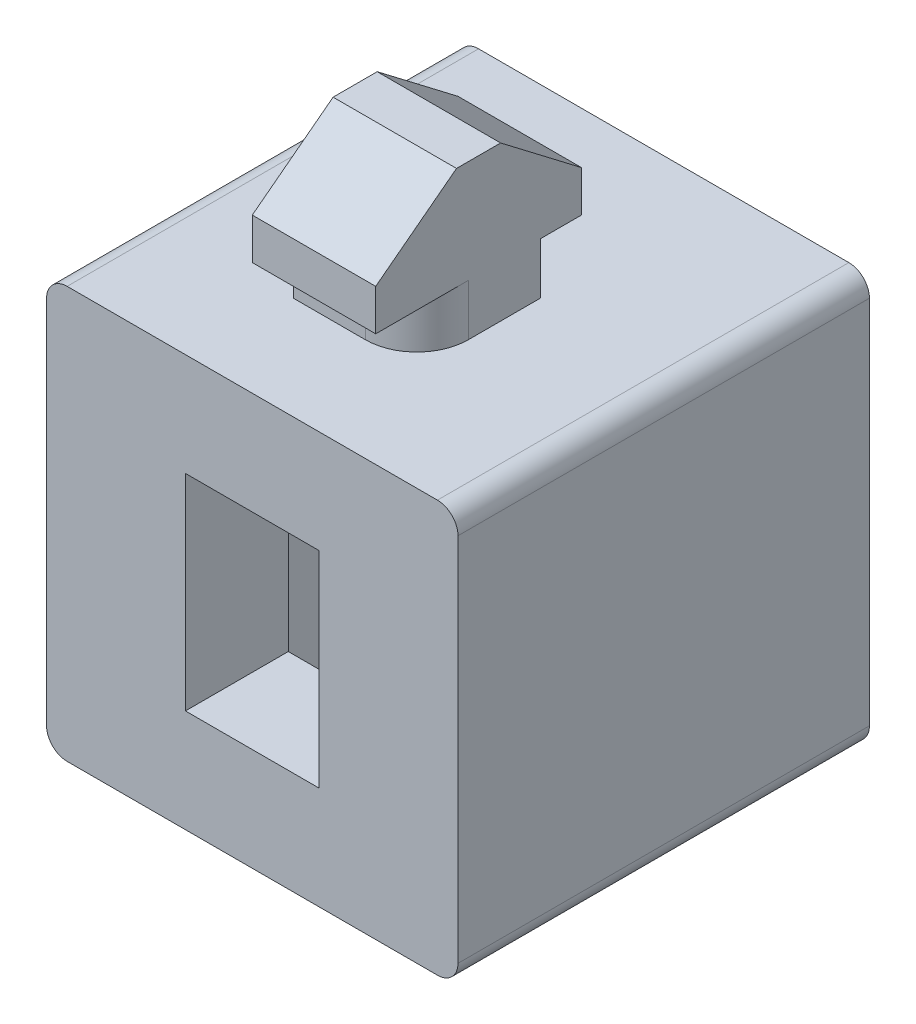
ISO-10303-21;
HEADER;
FILE_DESCRIPTION(('STEP AP214'),'2;1');
FILE_NAME('part.step','',(''),(''),'','','');
FILE_SCHEMA(('AUTOMOTIVE_DESIGN { 1 0 10303 214 1 1 1 1 }'));
ENDSEC;
DATA;
#1=APPLICATION_CONTEXT('core data for automotive mechanical design processes');
#2=APPLICATION_PROTOCOL_DEFINITION('international standard','automotive_design',2000,#1);
#3=PRODUCT_CONTEXT('',#1,'mechanical');
#4=PRODUCT('Part','Part','',(#3));
#5=PRODUCT_RELATED_PRODUCT_CATEGORY('part','',(#4));
#6=PRODUCT_DEFINITION_FORMATION('','',#4);
#7=PRODUCT_DEFINITION_CONTEXT('part definition',#1,'design');
#8=PRODUCT_DEFINITION('design','',#6,#7);
#9=PRODUCT_DEFINITION_SHAPE('','',#8);
#10=(LENGTH_UNIT() NAMED_UNIT(*) SI_UNIT(.MILLI.,.METRE.));
#11=(NAMED_UNIT(*) PLANE_ANGLE_UNIT() SI_UNIT($,.RADIAN.));
#12=(NAMED_UNIT(*) SI_UNIT($,.STERADIAN.) SOLID_ANGLE_UNIT());
#13=UNCERTAINTY_MEASURE_WITH_UNIT(LENGTH_MEASURE(1.E-05),#10,'distance_accuracy_value','');
#14=(GEOMETRIC_REPRESENTATION_CONTEXT(3) GLOBAL_UNCERTAINTY_ASSIGNED_CONTEXT((#13)) GLOBAL_UNIT_ASSIGNED_CONTEXT((#10,
#11,#12)) REPRESENTATION_CONTEXT('',''));
#15=CARTESIAN_POINT('',(0.,0.,0.));
#16=DIRECTION('',(0.,0.,1.));
#17=DIRECTION('',(1.,0.,0.));
#18=AXIS2_PLACEMENT_3D('',#15,#16,#17);
#19=CARTESIAN_POINT('',(-10.,10.,10.));
#20=DIRECTION('',(0.,-1.,0.));
#21=DIRECTION('',(1.,0.,0.));
#22=AXIS2_PLACEMENT_3D('',#19,#20,#21);
#23=PLANE('',#22);
#24=DIRECTION('',(-1.,0.,0.));
#25=VECTOR('',#24,1.);
#26=CARTESIAN_POINT('',(-10.,10.,10.));
#27=LINE('',#26,#25);
#28=CARTESIAN_POINT('',(9.,10.,10.));
#29=VERTEX_POINT('',#28);
#30=CARTESIAN_POINT('',(-9.,10.,10.));
#31=VERTEX_POINT('',#30);
#32=EDGE_CURVE('E382',#29,#31,#27,.T.);
#33=ORIENTED_EDGE('',*,*,#32,.F.);
#34=DIRECTION('',(0.,0.,-1.));
#35=VECTOR('',#34,1.);
#36=CARTESIAN_POINT('',(9.,10.,10.));
#37=LINE('',#36,#35);
#38=CARTESIAN_POINT('',(9.,10.,-10.));
#39=VERTEX_POINT('',#38);
#40=EDGE_CURVE('E328',#29,#39,#37,.T.);
#41=ORIENTED_EDGE('',*,*,#40,.T.);
#42=DIRECTION('',(-1.,0.,0.));
#43=VECTOR('',#42,1.);
#44=CARTESIAN_POINT('',(-10.,10.,-10.));
#45=LINE('',#44,#43);
#46=CARTESIAN_POINT('',(-9.,10.,-10.));
#47=VERTEX_POINT('',#46);
#48=EDGE_CURVE('E387',#39,#47,#45,.T.);
#49=ORIENTED_EDGE('',*,*,#48,.T.);
#50=DIRECTION('',(0.,0.,-1.));
#51=VECTOR('',#50,1.);
#52=CARTESIAN_POINT('',(-9.,10.,10.));
#53=LINE('',#52,#51);
#54=EDGE_CURVE('E326',#47,#31,#53,.F.);
#55=ORIENTED_EDGE('',*,*,#54,.T.);
#56=EDGE_LOOP('',(#33,#41,#49,#55));
#57=FACE_BOUND('',#56,.T.);
#58=DIRECTION('',(0.,0.,1.));
#59=VECTOR('',#58,1.);
#60=CARTESIAN_POINT('',(-3.,10.,-0.999999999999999));
#61=LINE('',#60,#59);
#62=CARTESIAN_POINT('',(-3.,10.,1.5));
#63=VERTEX_POINT('',#62);
#64=CARTESIAN_POINT('',(-3.,10.,5.));
#65=VERTEX_POINT('',#64);
#66=EDGE_CURVE('E305',#63,#65,#61,.T.);
#67=ORIENTED_EDGE('',*,*,#66,.F.);
#68=CARTESIAN_POINT('',(-0.500000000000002,10.,1.5));
#69=DIRECTION('',(0.,-1.,0.));
#70=DIRECTION('',(1.,0.,0.));
#71=AXIS2_PLACEMENT_3D('',#68,#69,#70);
#72=CIRCLE('',#71,2.5);
#73=CARTESIAN_POINT('',(-0.500000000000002,10.,-0.999999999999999));
#74=VERTEX_POINT('',#73);
#75=EDGE_CURVE('E400',#63,#74,#72,.T.);
#76=ORIENTED_EDGE('',*,*,#75,.T.);
#77=DIRECTION('',(-1.,0.,0.));
#78=VECTOR('',#77,1.);
#79=CARTESIAN_POINT('',(-3.,10.,-0.999999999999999));
#80=LINE('',#79,#78);
#81=CARTESIAN_POINT('',(3.,10.,-0.999999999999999));
#82=VERTEX_POINT('',#81);
#83=EDGE_CURVE('E302',#82,#74,#80,.T.);
#84=ORIENTED_EDGE('',*,*,#83,.F.);
#85=DIRECTION('',(0.,0.,-1.));
#86=VECTOR('',#85,1.);
#87=CARTESIAN_POINT('',(3.,10.,-0.999999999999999));
#88=LINE('',#87,#86);
#89=CARTESIAN_POINT('',(3.,10.,2.5));
#90=VERTEX_POINT('',#89);
#91=EDGE_CURVE('E577',#90,#82,#88,.T.);
#92=ORIENTED_EDGE('',*,*,#91,.F.);
#93=CARTESIAN_POINT('',(0.499999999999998,10.,2.5));
#94=DIRECTION('',(0.,-1.,0.));
#95=DIRECTION('',(1.,0.,0.));
#96=AXIS2_PLACEMENT_3D('',#93,#94,#95);
#97=CIRCLE('',#96,2.5);
#98=CARTESIAN_POINT('',(0.499999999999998,10.,5.));
#99=VERTEX_POINT('',#98);
#100=EDGE_CURVE('E329',#90,#99,#97,.T.);
#101=ORIENTED_EDGE('',*,*,#100,.T.);
#102=DIRECTION('',(1.,0.,0.));
#103=VECTOR('',#102,1.);
#104=CARTESIAN_POINT('',(-3.,10.,5.));
#105=LINE('',#104,#103);
#106=EDGE_CURVE('E574',#65,#99,#105,.T.);
#107=ORIENTED_EDGE('',*,*,#106,.F.);
#108=EDGE_LOOP('',(#67,#76,#84,#92,#101,#107));
#109=FACE_BOUND('',#108,.T.);
#110=ADVANCED_FACE('F34',(#57,#109),#23,.F.);
#111=CARTESIAN_POINT('',(-3.25,5.,10.));
#112=DIRECTION('',(1.,0.,0.));
#113=DIRECTION('',(0.,1.,0.));
#114=AXIS2_PLACEMENT_3D('',#111,#112,#113);
#115=PLANE('',#114);
#116=DIRECTION('',(0.,-1.,0.));
#117=VECTOR('',#116,1.);
#118=CARTESIAN_POINT('',(-3.25,5.,5.));
#119=LINE('',#118,#117);
#120=CARTESIAN_POINT('',(-3.25,5.,5.));
#121=VERTEX_POINT('',#120);
#122=CARTESIAN_POINT('',(-3.25,-5.,5.));
#123=VERTEX_POINT('',#122);
#124=EDGE_CURVE('E458',#121,#123,#119,.T.);
#125=ORIENTED_EDGE('',*,*,#124,.F.);
#126=DIRECTION('',(0.,0.,-1.));
#127=VECTOR('',#126,1.);
#128=CARTESIAN_POINT('',(-3.25,5.,10.));
#129=LINE('',#128,#127);
#130=CARTESIAN_POINT('',(-3.25,5.,10.));
#131=VERTEX_POINT('',#130);
#132=EDGE_CURVE('E482',#131,#121,#129,.T.);
#133=ORIENTED_EDGE('',*,*,#132,.F.);
#134=DIRECTION('',(0.,-1.,0.));
#135=VECTOR('',#134,1.);
#136=CARTESIAN_POINT('',(-3.25,5.,10.));
#137=LINE('',#136,#135);
#138=CARTESIAN_POINT('',(-3.25,-5.,10.));
#139=VERTEX_POINT('',#138);
#140=EDGE_CURVE('E461',#131,#139,#137,.T.);
#141=ORIENTED_EDGE('',*,*,#140,.T.);
#142=DIRECTION('',(0.,0.,-1.));
#143=VECTOR('',#142,1.);
#144=CARTESIAN_POINT('',(-3.25,-5.,10.));
#145=LINE('',#144,#143);
#146=EDGE_CURVE('E374',#139,#123,#145,.T.);
#147=ORIENTED_EDGE('',*,*,#146,.T.);
#148=EDGE_LOOP('',(#125,#133,#141,#147));
#149=FACE_BOUND('',#148,.T.);
#150=ADVANCED_FACE('F528',(#149),#115,.T.);
#151=CARTESIAN_POINT('',(-3.25,-5.,10.));
#152=DIRECTION('',(0.,1.,0.));
#153=DIRECTION('',(-1.,0.,0.));
#154=AXIS2_PLACEMENT_3D('',#151,#152,#153);
#155=PLANE('',#154);
#156=DIRECTION('',(1.,0.,0.));
#157=VECTOR('',#156,1.);
#158=CARTESIAN_POINT('',(-3.25,-5.,5.));
#159=LINE('',#158,#157);
#160=CARTESIAN_POINT('',(3.25,-5.,5.));
#161=VERTEX_POINT('',#160);
#162=EDGE_CURVE('E456',#123,#161,#159,.T.);
#163=ORIENTED_EDGE('',*,*,#162,.F.);
#164=ORIENTED_EDGE('',*,*,#146,.F.);
#165=DIRECTION('',(1.,0.,0.));
#166=VECTOR('',#165,1.);
#167=CARTESIAN_POINT('',(-3.25,-5.,10.));
#168=LINE('',#167,#166);
#169=CARTESIAN_POINT('',(3.25,-5.,10.));
#170=VERTEX_POINT('',#169);
#171=EDGE_CURVE('E463',#139,#170,#168,.T.);
#172=ORIENTED_EDGE('',*,*,#171,.T.);
#173=DIRECTION('',(0.,0.,-1.));
#174=VECTOR('',#173,1.);
#175=CARTESIAN_POINT('',(3.25,-5.,10.));
#176=LINE('',#175,#174);
#177=EDGE_CURVE('E490',#170,#161,#176,.T.);
#178=ORIENTED_EDGE('',*,*,#177,.T.);
#179=EDGE_LOOP('',(#163,#164,#172,#178));
#180=FACE_BOUND('',#179,.T.);
#181=ADVANCED_FACE('F533',(#180),#155,.T.);
#182=CARTESIAN_POINT('',(3.25,5.,10.));
#183=DIRECTION('',(-1.,0.,0.));
#184=DIRECTION('',(0.,-1.,0.));
#185=AXIS2_PLACEMENT_3D('',#182,#183,#184);
#186=PLANE('',#185);
#187=DIRECTION('',(0.,1.,0.));
#188=VECTOR('',#187,1.);
#189=CARTESIAN_POINT('',(3.25,5.,5.));
#190=LINE('',#189,#188);
#191=CARTESIAN_POINT('',(3.25,5.,5.));
#192=VERTEX_POINT('',#191);
#193=EDGE_CURVE('E454',#161,#192,#190,.T.);
#194=ORIENTED_EDGE('',*,*,#193,.F.);
#195=ORIENTED_EDGE('',*,*,#177,.F.);
#196=DIRECTION('',(0.,1.,0.));
#197=VECTOR('',#196,1.);
#198=CARTESIAN_POINT('',(3.25,5.,10.));
#199=LINE('',#198,#197);
#200=CARTESIAN_POINT('',(3.25,5.,10.));
#201=VERTEX_POINT('',#200);
#202=EDGE_CURVE('E466',#170,#201,#199,.T.);
#203=ORIENTED_EDGE('',*,*,#202,.T.);
#204=DIRECTION('',(0.,0.,-1.));
#205=VECTOR('',#204,1.);
#206=CARTESIAN_POINT('',(3.25,5.,10.));
#207=LINE('',#206,#205);
#208=EDGE_CURVE('E486',#201,#192,#207,.T.);
#209=ORIENTED_EDGE('',*,*,#208,.T.);
#210=EDGE_LOOP('',(#194,#195,#203,#209));
#211=FACE_BOUND('',#210,.T.);
#212=ADVANCED_FACE('F650',(#211),#186,.T.);
#213=CARTESIAN_POINT('',(-3.25,5.,10.));
#214=DIRECTION('',(0.,-1.,0.));
#215=DIRECTION('',(0.,0.,-1.));
#216=AXIS2_PLACEMENT_3D('',#213,#214,#215);
#217=PLANE('',#216);
#218=DIRECTION('',(-1.,0.,0.));
#219=VECTOR('',#218,1.);
#220=CARTESIAN_POINT('',(-3.25,5.,5.));
#221=LINE('',#220,#219);
#222=EDGE_CURVE('E323',#192,#121,#221,.T.);
#223=ORIENTED_EDGE('',*,*,#222,.F.);
#224=ORIENTED_EDGE('',*,*,#208,.F.);
#225=DIRECTION('',(-1.,0.,0.));
#226=VECTOR('',#225,1.);
#227=CARTESIAN_POINT('',(-3.25,5.,10.));
#228=LINE('',#227,#226);
#229=EDGE_CURVE('E469',#201,#131,#228,.T.);
#230=ORIENTED_EDGE('',*,*,#229,.T.);
#231=ORIENTED_EDGE('',*,*,#132,.T.);
#232=EDGE_LOOP('',(#223,#224,#230,#231));
#233=FACE_BOUND('',#232,.T.);
#234=ADVANCED_FACE('F645',(#233),#217,.T.);
#235=CARTESIAN_POINT('',(0.,0.,10.));
#236=DIRECTION('',(0.,0.,1.));
#237=DIRECTION('',(1.,0.,0.));
#238=AXIS2_PLACEMENT_3D('',#235,#236,#237);
#239=PLANE('',#238);
#240=DIRECTION('',(0.,1.,0.));
#241=VECTOR('',#240,1.);
#242=CARTESIAN_POINT('',(10.,10.,10.));
#243=LINE('',#242,#241);
#244=CARTESIAN_POINT('',(10.,-9.,10.));
#245=VERTEX_POINT('',#244);
#246=CARTESIAN_POINT('',(10.,9.,10.));
#247=VERTEX_POINT('',#246);
#248=EDGE_CURVE('E495',#245,#247,#243,.T.);
#249=ORIENTED_EDGE('',*,*,#248,.T.);
#250=CARTESIAN_POINT('',(9.,9.,10.));
#251=DIRECTION('',(0.,0.,1.));
#252=DIRECTION('',(1.,0.,0.));
#253=AXIS2_PLACEMENT_3D('',#250,#251,#252);
#254=CIRCLE('',#253,1.);
#255=EDGE_CURVE('E350',#247,#29,#254,.T.);
#256=ORIENTED_EDGE('',*,*,#255,.T.);
#257=ORIENTED_EDGE('',*,*,#32,.T.);
#258=CARTESIAN_POINT('',(-9.,9.,10.));
#259=DIRECTION('',(0.,0.,1.));
#260=DIRECTION('',(1.,0.,0.));
#261=AXIS2_PLACEMENT_3D('',#258,#259,#260);
#262=CIRCLE('',#261,1.);
#263=CARTESIAN_POINT('',(-10.,9.,10.));
#264=VERTEX_POINT('',#263);
#265=EDGE_CURVE('E348',#31,#264,#262,.T.);
#266=ORIENTED_EDGE('',*,*,#265,.T.);
#267=DIRECTION('',(0.,-1.,0.));
#268=VECTOR('',#267,1.);
#269=CARTESIAN_POINT('',(-10.,10.,10.));
#270=LINE('',#269,#268);
#271=CARTESIAN_POINT('',(-10.,-9.,10.));
#272=VERTEX_POINT('',#271);
#273=EDGE_CURVE('E364',#264,#272,#270,.T.);
#274=ORIENTED_EDGE('',*,*,#273,.T.);
#275=CARTESIAN_POINT('',(-9.,-9.,10.));
#276=DIRECTION('',(0.,0.,1.));
#277=DIRECTION('',(1.,0.,0.));
#278=AXIS2_PLACEMENT_3D('',#275,#276,#277);
#279=CIRCLE('',#278,1.);
#280=CARTESIAN_POINT('',(-9.,-10.,10.));
#281=VERTEX_POINT('',#280);
#282=EDGE_CURVE('E55',#272,#281,#279,.T.);
#283=ORIENTED_EDGE('',*,*,#282,.T.);
#284=DIRECTION('',(1.,0.,0.));
#285=VECTOR('',#284,1.);
#286=CARTESIAN_POINT('',(-10.,-10.,10.));
#287=LINE('',#286,#285);
#288=CARTESIAN_POINT('',(9.,-10.,10.));
#289=VERTEX_POINT('',#288);
#290=EDGE_CURVE('E494',#281,#289,#287,.T.);
#291=ORIENTED_EDGE('',*,*,#290,.T.);
#292=CARTESIAN_POINT('',(9.,-9.,10.));
#293=DIRECTION('',(0.,0.,1.));
#294=DIRECTION('',(1.,0.,0.));
#295=AXIS2_PLACEMENT_3D('',#292,#293,#294);
#296=CIRCLE('',#295,1.);
#297=EDGE_CURVE('E345',#289,#245,#296,.T.);
#298=ORIENTED_EDGE('',*,*,#297,.T.);
#299=EDGE_LOOP('',(#249,#256,#257,#266,#274,#283,#291,#298));
#300=FACE_BOUND('',#299,.T.);
#301=ORIENTED_EDGE('',*,*,#171,.F.);
#302=ORIENTED_EDGE('',*,*,#140,.F.);
#303=ORIENTED_EDGE('',*,*,#229,.F.);
#304=ORIENTED_EDGE('',*,*,#202,.F.);
#305=EDGE_LOOP('',(#301,#302,#303,#304));
#306=FACE_BOUND('',#305,.T.);
#307=ADVANCED_FACE('F501',(#300,#306),#239,.T.);
#308=CARTESIAN_POINT('',(0.,0.,-10.));
#309=DIRECTION('',(0.,0.,1.));
#310=DIRECTION('',(1.,0.,0.));
#311=AXIS2_PLACEMENT_3D('',#308,#309,#310);
#312=PLANE('',#311);
#313=ORIENTED_EDGE('',*,*,#48,.F.);
#314=CARTESIAN_POINT('',(9.,9.,-10.));
#315=DIRECTION('',(0.,0.,1.));
#316=DIRECTION('',(1.,0.,0.));
#317=AXIS2_PLACEMENT_3D('',#314,#315,#316);
#318=CIRCLE('',#317,1.);
#319=CARTESIAN_POINT('',(10.,9.,-10.));
#320=VERTEX_POINT('',#319);
#321=EDGE_CURVE('E338',#39,#320,#318,.F.);
#322=ORIENTED_EDGE('',*,*,#321,.T.);
#323=DIRECTION('',(0.,1.,0.));
#324=VECTOR('',#323,1.);
#325=CARTESIAN_POINT('',(10.,10.,-10.));
#326=LINE('',#325,#324);
#327=CARTESIAN_POINT('',(10.,-9.,-10.));
#328=VERTEX_POINT('',#327);
#329=EDGE_CURVE('E376',#328,#320,#326,.T.);
#330=ORIENTED_EDGE('',*,*,#329,.F.);
#331=CARTESIAN_POINT('',(9.,-9.,-10.));
#332=DIRECTION('',(0.,0.,1.));
#333=DIRECTION('',(1.,0.,0.));
#334=AXIS2_PLACEMENT_3D('',#331,#332,#333);
#335=CIRCLE('',#334,1.);
#336=CARTESIAN_POINT('',(9.,-10.,-10.));
#337=VERTEX_POINT('',#336);
#338=EDGE_CURVE('E332',#328,#337,#335,.F.);
#339=ORIENTED_EDGE('',*,*,#338,.T.);
#340=DIRECTION('',(1.,0.,0.));
#341=VECTOR('',#340,1.);
#342=CARTESIAN_POINT('',(-10.,-10.,-10.));
#343=LINE('',#342,#341);
#344=CARTESIAN_POINT('',(-9.,-10.,-10.));
#345=VERTEX_POINT('',#344);
#346=EDGE_CURVE('E373',#345,#337,#343,.T.);
#347=ORIENTED_EDGE('',*,*,#346,.F.);
#348=CARTESIAN_POINT('',(-9.,-9.,-10.));
#349=DIRECTION('',(0.,0.,1.));
#350=DIRECTION('',(1.,0.,0.));
#351=AXIS2_PLACEMENT_3D('',#348,#349,#350);
#352=CIRCLE('',#351,1.);
#353=CARTESIAN_POINT('',(-10.,-9.,-10.));
#354=VERTEX_POINT('',#353);
#355=EDGE_CURVE('E334',#345,#354,#352,.F.);
#356=ORIENTED_EDGE('',*,*,#355,.T.);
#357=DIRECTION('',(0.,-1.,0.));
#358=VECTOR('',#357,1.);
#359=CARTESIAN_POINT('',(-10.,10.,-10.));
#360=LINE('',#359,#358);
#361=CARTESIAN_POINT('',(-10.,9.,-10.));
#362=VERTEX_POINT('',#361);
#363=EDGE_CURVE('E362',#362,#354,#360,.T.);
#364=ORIENTED_EDGE('',*,*,#363,.F.);
#365=CARTESIAN_POINT('',(-9.,9.,-10.));
#366=DIRECTION('',(0.,0.,1.));
#367=DIRECTION('',(1.,0.,0.));
#368=AXIS2_PLACEMENT_3D('',#365,#366,#367);
#369=CIRCLE('',#368,1.);
#370=EDGE_CURVE('E336',#362,#47,#369,.F.);
#371=ORIENTED_EDGE('',*,*,#370,.T.);
#372=EDGE_LOOP('',(#313,#322,#330,#339,#347,#356,#364,#371));
#373=FACE_BOUND('',#372,.T.);
#374=DIRECTION('',(0.,-1.,0.));
#375=VECTOR('',#374,1.);
#376=CARTESIAN_POINT('',(-3.25,5.,-10.));
#377=LINE('',#376,#375);
#378=CARTESIAN_POINT('',(-3.25,5.,-10.));
#379=VERTEX_POINT('',#378);
#380=CARTESIAN_POINT('',(-3.25,-5.,-10.));
#381=VERTEX_POINT('',#380);
#382=EDGE_CURVE('E460',#379,#381,#377,.T.);
#383=ORIENTED_EDGE('',*,*,#382,.T.);
#384=DIRECTION('',(1.,0.,0.));
#385=VECTOR('',#384,1.);
#386=CARTESIAN_POINT('',(-3.25,-5.,-10.));
#387=LINE('',#386,#385);
#388=CARTESIAN_POINT('',(3.25,-5.,-10.));
#389=VERTEX_POINT('',#388);
#390=EDGE_CURVE('E474',#381,#389,#387,.T.);
#391=ORIENTED_EDGE('',*,*,#390,.T.);
#392=DIRECTION('',(0.,1.,0.));
#393=VECTOR('',#392,1.);
#394=CARTESIAN_POINT('',(3.25,5.,-10.));
#395=LINE('',#394,#393);
#396=CARTESIAN_POINT('',(3.25,5.,-10.));
#397=VERTEX_POINT('',#396);
#398=EDGE_CURVE('E477',#389,#397,#395,.T.);
#399=ORIENTED_EDGE('',*,*,#398,.T.);
#400=DIRECTION('',(-1.,0.,0.));
#401=VECTOR('',#400,1.);
#402=CARTESIAN_POINT('',(-3.25,5.,-10.));
#403=LINE('',#402,#401);
#404=EDGE_CURVE('E464',#397,#379,#403,.T.);
#405=ORIENTED_EDGE('',*,*,#404,.T.);
#406=EDGE_LOOP('',(#383,#391,#399,#405));
#407=FACE_BOUND('',#406,.T.);
#408=ADVANCED_FACE('F369',(#373,#407),#312,.F.);
#409=CARTESIAN_POINT('',(-10.,10.,10.));
#410=DIRECTION('',(1.,0.,0.));
#411=DIRECTION('',(0.,0.,-1.));
#412=AXIS2_PLACEMENT_3D('',#409,#410,#411);
#413=PLANE('',#412);
#414=ORIENTED_EDGE('',*,*,#273,.F.);
#415=DIRECTION('',(0.,0.,-1.));
#416=VECTOR('',#415,1.);
#417=CARTESIAN_POINT('',(-10.,9.,10.));
#418=LINE('',#417,#416);
#419=EDGE_CURVE('E354',#264,#362,#418,.T.);
#420=ORIENTED_EDGE('',*,*,#419,.T.);
#421=ORIENTED_EDGE('',*,*,#363,.T.);
#422=DIRECTION('',(0.,0.,-1.));
#423=VECTOR('',#422,1.);
#424=CARTESIAN_POINT('',(-10.,-9.,10.));
#425=LINE('',#424,#423);
#426=EDGE_CURVE('E352',#354,#272,#425,.F.);
#427=ORIENTED_EDGE('',*,*,#426,.T.);
#428=EDGE_LOOP('',(#414,#420,#421,#427));
#429=FACE_BOUND('',#428,.T.);
#430=ADVANCED_FACE('F361',(#429),#413,.F.);
#431=CARTESIAN_POINT('',(-10.,-10.,10.));
#432=DIRECTION('',(0.,1.,0.));
#433=DIRECTION('',(0.,0.,1.));
#434=AXIS2_PLACEMENT_3D('',#431,#432,#433);
#435=PLANE('',#434);
#436=DIRECTION('',(1.,0.,0.));
#437=VECTOR('',#436,1.);
#438=CARTESIAN_POINT('',(-5.,-10.,0.));
#439=LINE('',#438,#437);
#440=CARTESIAN_POINT('',(-5.,-10.,0.));
#441=VERTEX_POINT('',#440);
#442=CARTESIAN_POINT('',(5.,-10.,0.));
#443=VERTEX_POINT('',#442);
#444=EDGE_CURVE('E414',#441,#443,#439,.T.);
#445=ORIENTED_EDGE('',*,*,#444,.F.);
#446=DIRECTION('',(0.,0.,-1.));
#447=VECTOR('',#446,1.);
#448=CARTESIAN_POINT('',(-5.,-10.,5.));
#449=LINE('',#448,#447);
#450=CARTESIAN_POINT('',(-5.,-10.,5.));
#451=VERTEX_POINT('',#450);
#452=EDGE_CURVE('E409',#451,#441,#449,.T.);
#453=ORIENTED_EDGE('',*,*,#452,.F.);
#454=DIRECTION('',(-1.,0.,0.));
#455=VECTOR('',#454,1.);
#456=CARTESIAN_POINT('',(-5.,-10.,5.));
#457=LINE('',#456,#455);
#458=CARTESIAN_POINT('',(5.,-10.,5.));
#459=VERTEX_POINT('',#458);
#460=EDGE_CURVE('E423',#459,#451,#457,.T.);
#461=ORIENTED_EDGE('',*,*,#460,.F.);
#462=DIRECTION('',(0.,0.,1.));
#463=VECTOR('',#462,1.);
#464=CARTESIAN_POINT('',(5.,-10.,5.));
#465=LINE('',#464,#463);
#466=EDGE_CURVE('E435',#443,#459,#465,.T.);
#467=ORIENTED_EDGE('',*,*,#466,.F.);
#468=EDGE_LOOP('',(#445,#453,#461,#467));
#469=FACE_BOUND('',#468,.T.);
#470=ORIENTED_EDGE('',*,*,#290,.F.);
#471=DIRECTION('',(0.,0.,-1.));
#472=VECTOR('',#471,1.);
#473=CARTESIAN_POINT('',(-9.,-10.,10.));
#474=LINE('',#473,#472);
#475=EDGE_CURVE('E11',#281,#345,#474,.T.);
#476=ORIENTED_EDGE('',*,*,#475,.T.);
#477=ORIENTED_EDGE('',*,*,#346,.T.);
#478=DIRECTION('',(0.,0.,-1.));
#479=VECTOR('',#478,1.);
#480=CARTESIAN_POINT('',(9.,-10.,10.));
#481=LINE('',#480,#479);
#482=EDGE_CURVE('E42',#337,#289,#481,.F.);
#483=ORIENTED_EDGE('',*,*,#482,.T.);
#484=EDGE_LOOP('',(#470,#476,#477,#483));
#485=FACE_BOUND('',#484,.T.);
#486=ADVANCED_FACE('F542',(#469,#485),#435,.F.);
#487=CARTESIAN_POINT('',(10.,10.,10.));
#488=DIRECTION('',(-1.,0.,0.));
#489=DIRECTION('',(0.,0.,1.));
#490=AXIS2_PLACEMENT_3D('',#487,#488,#489);
#491=PLANE('',#490);
#492=ORIENTED_EDGE('',*,*,#329,.T.);
#493=DIRECTION('',(0.,0.,-1.));
#494=VECTOR('',#493,1.);
#495=CARTESIAN_POINT('',(10.,9.,10.));
#496=LINE('',#495,#494);
#497=EDGE_CURVE('E343',#320,#247,#496,.F.);
#498=ORIENTED_EDGE('',*,*,#497,.T.);
#499=ORIENTED_EDGE('',*,*,#248,.F.);
#500=DIRECTION('',(0.,0.,-1.));
#501=VECTOR('',#500,1.);
#502=CARTESIAN_POINT('',(10.,-9.,10.));
#503=LINE('',#502,#501);
#504=EDGE_CURVE('E340',#245,#328,#503,.T.);
#505=ORIENTED_EDGE('',*,*,#504,.T.);
#506=EDGE_LOOP('',(#492,#498,#499,#505));
#507=FACE_BOUND('',#506,.T.);
#508=ADVANCED_FACE('F512',(#507),#491,.F.);
#509=DIRECTION('',(0.,1.,0.));
#510=VECTOR('',#509,1.);
#511=CARTESIAN_POINT('',(-3.25,5.,0.));
#512=LINE('',#511,#510);
#513=CARTESIAN_POINT('',(-3.25,-5.,0.));
#514=VERTEX_POINT('',#513);
#515=CARTESIAN_POINT('',(-3.25,5.,0.));
#516=VERTEX_POINT('',#515);
#517=EDGE_CURVE('E452',#514,#516,#512,.T.);
#518=ORIENTED_EDGE('',*,*,#517,.F.);
#519=EDGE_CURVE('E379',#514,#381,#145,.T.);
#520=ORIENTED_EDGE('',*,*,#519,.T.);
#521=ORIENTED_EDGE('',*,*,#382,.F.);
#522=EDGE_CURVE('E471',#516,#379,#129,.T.);
#523=ORIENTED_EDGE('',*,*,#522,.F.);
#524=EDGE_LOOP('',(#518,#520,#521,#523));
#525=FACE_BOUND('',#524,.T.);
#526=ADVANCED_FACE('F536',(#525),#115,.T.);
#527=DIRECTION('',(-1.,0.,0.));
#528=VECTOR('',#527,1.);
#529=CARTESIAN_POINT('',(-3.25,-5.,0.));
#530=LINE('',#529,#528);
#531=CARTESIAN_POINT('',(3.25,-5.,0.));
#532=VERTEX_POINT('',#531);
#533=EDGE_CURVE('E450',#532,#514,#530,.T.);
#534=ORIENTED_EDGE('',*,*,#533,.F.);
#535=EDGE_CURVE('E489',#532,#389,#176,.T.);
#536=ORIENTED_EDGE('',*,*,#535,.T.);
#537=ORIENTED_EDGE('',*,*,#390,.F.);
#538=ORIENTED_EDGE('',*,*,#519,.F.);
#539=EDGE_LOOP('',(#534,#536,#537,#538));
#540=FACE_BOUND('',#539,.T.);
#541=ADVANCED_FACE('F648',(#540),#155,.T.);
#542=DIRECTION('',(0.,-1.,0.));
#543=VECTOR('',#542,1.);
#544=CARTESIAN_POINT('',(3.25,5.,0.));
#545=LINE('',#544,#543);
#546=CARTESIAN_POINT('',(3.25,5.,0.));
#547=VERTEX_POINT('',#546);
#548=EDGE_CURVE('E442',#547,#532,#545,.T.);
#549=ORIENTED_EDGE('',*,*,#548,.F.);
#550=EDGE_CURVE('E485',#547,#397,#207,.T.);
#551=ORIENTED_EDGE('',*,*,#550,.T.);
#552=ORIENTED_EDGE('',*,*,#398,.F.);
#553=ORIENTED_EDGE('',*,*,#535,.F.);
#554=EDGE_LOOP('',(#549,#551,#552,#553));
#555=FACE_BOUND('',#554,.T.);
#556=ADVANCED_FACE('F643',(#555),#186,.T.);
#557=DIRECTION('',(1.,0.,0.));
#558=VECTOR('',#557,1.);
#559=CARTESIAN_POINT('',(-3.25,5.,0.));
#560=LINE('',#559,#558);
#561=EDGE_CURVE('E389',#516,#547,#560,.T.);
#562=ORIENTED_EDGE('',*,*,#561,.F.);
#563=ORIENTED_EDGE('',*,*,#522,.T.);
#564=ORIENTED_EDGE('',*,*,#404,.F.);
#565=ORIENTED_EDGE('',*,*,#550,.F.);
#566=EDGE_LOOP('',(#562,#563,#564,#565));
#567=FACE_BOUND('',#566,.T.);
#568=ADVANCED_FACE('F639',(#567),#217,.T.);
#569=CARTESIAN_POINT('',(-5.,7.,5.));
#570=DIRECTION('',(-1.,0.,0.));
#571=DIRECTION('',(0.,0.,1.));
#572=AXIS2_PLACEMENT_3D('',#569,#570,#571);
#573=PLANE('',#572);
#574=ORIENTED_EDGE('',*,*,#452,.T.);
#575=DIRECTION('',(0.,-1.,0.));
#576=VECTOR('',#575,1.);
#577=CARTESIAN_POINT('',(-5.,7.,0.));
#578=LINE('',#577,#576);
#579=CARTESIAN_POINT('',(-5.,7.,0.));
#580=VERTEX_POINT('',#579);
#581=EDGE_CURVE('E431',#580,#441,#578,.T.);
#582=ORIENTED_EDGE('',*,*,#581,.F.);
#583=DIRECTION('',(0.,0.,-1.));
#584=VECTOR('',#583,1.);
#585=CARTESIAN_POINT('',(-5.,7.,5.));
#586=LINE('',#585,#584);
#587=CARTESIAN_POINT('',(-5.,7.,5.));
#588=VERTEX_POINT('',#587);
#589=EDGE_CURVE('E419',#588,#580,#586,.T.);
#590=ORIENTED_EDGE('',*,*,#589,.F.);
#591=DIRECTION('',(0.,-1.,0.));
#592=VECTOR('',#591,1.);
#593=CARTESIAN_POINT('',(-5.,7.,5.));
#594=LINE('',#593,#592);
#595=EDGE_CURVE('E440',#588,#451,#594,.T.);
#596=ORIENTED_EDGE('',*,*,#595,.T.);
#597=EDGE_LOOP('',(#574,#582,#590,#596));
#598=FACE_BOUND('',#597,.T.);
#599=ADVANCED_FACE('F629',(#598),#573,.F.);
#600=CARTESIAN_POINT('',(-5.,7.,5.));
#601=DIRECTION('',(0.,0.,1.));
#602=DIRECTION('',(1.,0.,0.));
#603=AXIS2_PLACEMENT_3D('',#600,#601,#602);
#604=PLANE('',#603);
#605=ORIENTED_EDGE('',*,*,#124,.T.);
#606=ORIENTED_EDGE('',*,*,#162,.T.);
#607=ORIENTED_EDGE('',*,*,#193,.T.);
#608=ORIENTED_EDGE('',*,*,#222,.T.);
#609=EDGE_LOOP('',(#605,#606,#607,#608));
#610=FACE_BOUND('',#609,.T.);
#611=ORIENTED_EDGE('',*,*,#460,.T.);
#612=ORIENTED_EDGE('',*,*,#595,.F.);
#613=DIRECTION('',(-1.,0.,0.));
#614=VECTOR('',#613,1.);
#615=CARTESIAN_POINT('',(-5.,7.,5.));
#616=LINE('',#615,#614);
#617=CARTESIAN_POINT('',(5.,7.,5.));
#618=VERTEX_POINT('',#617);
#619=EDGE_CURVE('E429',#618,#588,#616,.T.);
#620=ORIENTED_EDGE('',*,*,#619,.F.);
#621=DIRECTION('',(0.,-1.,0.));
#622=VECTOR('',#621,1.);
#623=CARTESIAN_POINT('',(5.,7.,5.));
#624=LINE('',#623,#622);
#625=EDGE_CURVE('E443',#618,#459,#624,.T.);
#626=ORIENTED_EDGE('',*,*,#625,.T.);
#627=EDGE_LOOP('',(#611,#612,#620,#626));
#628=FACE_BOUND('',#627,.T.);
#629=ADVANCED_FACE('F625',(#610,#628),#604,.F.);
#630=CARTESIAN_POINT('',(5.,7.,5.));
#631=DIRECTION('',(1.,0.,0.));
#632=DIRECTION('',(0.,0.,-1.));
#633=AXIS2_PLACEMENT_3D('',#630,#631,#632);
#634=PLANE('',#633);
#635=ORIENTED_EDGE('',*,*,#466,.T.);
#636=ORIENTED_EDGE('',*,*,#625,.F.);
#637=DIRECTION('',(0.,0.,1.));
#638=VECTOR('',#637,1.);
#639=CARTESIAN_POINT('',(5.,7.,5.));
#640=LINE('',#639,#638);
#641=CARTESIAN_POINT('',(5.,7.,0.));
#642=VERTEX_POINT('',#641);
#643=EDGE_CURVE('E426',#642,#618,#640,.T.);
#644=ORIENTED_EDGE('',*,*,#643,.F.);
#645=DIRECTION('',(0.,-1.,0.));
#646=VECTOR('',#645,1.);
#647=CARTESIAN_POINT('',(5.,7.,0.));
#648=LINE('',#647,#646);
#649=EDGE_CURVE('E445',#642,#443,#648,.T.);
#650=ORIENTED_EDGE('',*,*,#649,.T.);
#651=EDGE_LOOP('',(#635,#636,#644,#650));
#652=FACE_BOUND('',#651,.T.);
#653=ADVANCED_FACE('F628',(#652),#634,.F.);
#654=CARTESIAN_POINT('',(-5.,7.,0.));
#655=DIRECTION('',(0.,0.,-1.));
#656=DIRECTION('',(-1.,0.,0.));
#657=AXIS2_PLACEMENT_3D('',#654,#655,#656);
#658=PLANE('',#657);
#659=ORIENTED_EDGE('',*,*,#517,.T.);
#660=ORIENTED_EDGE('',*,*,#561,.T.);
#661=ORIENTED_EDGE('',*,*,#548,.T.);
#662=ORIENTED_EDGE('',*,*,#533,.T.);
#663=EDGE_LOOP('',(#659,#660,#661,#662));
#664=FACE_BOUND('',#663,.T.);
#665=ORIENTED_EDGE('',*,*,#444,.T.);
#666=ORIENTED_EDGE('',*,*,#649,.F.);
#667=DIRECTION('',(1.,0.,0.));
#668=VECTOR('',#667,1.);
#669=CARTESIAN_POINT('',(-5.,7.,0.));
#670=LINE('',#669,#668);
#671=EDGE_CURVE('E422',#580,#642,#670,.T.);
#672=ORIENTED_EDGE('',*,*,#671,.F.);
#673=ORIENTED_EDGE('',*,*,#581,.T.);
#674=EDGE_LOOP('',(#665,#666,#672,#673));
#675=FACE_BOUND('',#674,.T.);
#676=ADVANCED_FACE('F623',(#664,#675),#658,.F.);
#677=CARTESIAN_POINT('',(0.,7.,0.));
#678=DIRECTION('',(0.,-1.,0.));
#679=DIRECTION('',(0.,0.,-1.));
#680=AXIS2_PLACEMENT_3D('',#677,#678,#679);
#681=PLANE('',#680);
#682=ORIENTED_EDGE('',*,*,#589,.T.);
#683=ORIENTED_EDGE('',*,*,#671,.T.);
#684=ORIENTED_EDGE('',*,*,#643,.T.);
#685=ORIENTED_EDGE('',*,*,#619,.T.);
#686=EDGE_LOOP('',(#682,#683,#684,#685));
#687=FACE_BOUND('',#686,.T.);
#688=ADVANCED_FACE('F620',(#687),#681,.T.);
#689=CARTESIAN_POINT('',(-3.,12.5,-0.999999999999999));
#690=DIRECTION('',(1.,0.,0.));
#691=DIRECTION('',(0.,0.,-1.));
#692=AXIS2_PLACEMENT_3D('',#689,#690,#691);
#693=PLANE('',#692);
#694=DIRECTION('',(0.,-1.,0.));
#695=VECTOR('',#694,1.);
#696=CARTESIAN_POINT('',(-3.,12.5,5.));
#697=LINE('',#696,#695);
#698=CARTESIAN_POINT('',(-3.,12.5,5.));
#699=VERTEX_POINT('',#698);
#700=EDGE_CURVE('E403',#699,#65,#697,.T.);
#701=ORIENTED_EDGE('',*,*,#700,.F.);
#702=DIRECTION('',(0.,0.,1.));
#703=VECTOR('',#702,1.);
#704=CARTESIAN_POINT('',(-3.,12.5,2.));
#705=LINE('',#704,#703);
#706=CARTESIAN_POINT('',(-3.,12.5,7.));
#707=VERTEX_POINT('',#706);
#708=EDGE_CURVE('E272',#699,#707,#705,.T.);
#709=ORIENTED_EDGE('',*,*,#708,.T.);
#710=DIRECTION('',(0.,1.,0.));
#711=VECTOR('',#710,1.);
#712=CARTESIAN_POINT('',(-3.,12.5,7.));
#713=LINE('',#712,#711);
#714=CARTESIAN_POINT('',(-3.,14.5,7.));
#715=VERTEX_POINT('',#714);
#716=EDGE_CURVE('E276',#707,#715,#713,.T.);
#717=ORIENTED_EDGE('',*,*,#716,.T.);
#718=DIRECTION('',(0.,0.606938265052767,-0.794748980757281));
#719=VECTOR('',#718,1.);
#720=CARTESIAN_POINT('',(-3.,14.5,7.));
#721=LINE('',#720,#719);
#722=CARTESIAN_POINT('',(-3.,17.5,3.07168129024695));
#723=VERTEX_POINT('',#722);
#724=EDGE_CURVE('E281',#715,#723,#721,.T.);
#725=ORIENTED_EDGE('',*,*,#724,.T.);
#726=DIRECTION('',(0.,0.,1.));
#727=VECTOR('',#726,1.);
#728=CARTESIAN_POINT('',(-3.,17.5,0.928318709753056));
#729=LINE('',#728,#727);
#730=CARTESIAN_POINT('',(-3.,17.5,0.928318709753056));
#731=VERTEX_POINT('',#730);
#732=EDGE_CURVE('E263',#731,#723,#729,.T.);
#733=ORIENTED_EDGE('',*,*,#732,.F.);
#734=DIRECTION('',(0.,0.606938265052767,0.794748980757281));
#735=VECTOR('',#734,1.);
#736=CARTESIAN_POINT('',(-3.,14.5,-3.));
#737=LINE('',#736,#735);
#738=CARTESIAN_POINT('',(-3.,14.5,-3.));
#739=VERTEX_POINT('',#738);
#740=EDGE_CURVE('E586',#739,#731,#737,.T.);
#741=ORIENTED_EDGE('',*,*,#740,.F.);
#742=DIRECTION('',(0.,1.,0.));
#743=VECTOR('',#742,1.);
#744=CARTESIAN_POINT('',(-3.,12.5,-3.));
#745=LINE('',#744,#743);
#746=CARTESIAN_POINT('',(-3.,12.5,-3.));
#747=VERTEX_POINT('',#746);
#748=EDGE_CURVE('E585',#747,#739,#745,.T.);
#749=ORIENTED_EDGE('',*,*,#748,.F.);
#750=DIRECTION('',(0.,0.,-1.));
#751=VECTOR('',#750,1.);
#752=CARTESIAN_POINT('',(-3.,12.5,2.));
#753=LINE('',#752,#751);
#754=CARTESIAN_POINT('',(-3.,12.5,1.5));
#755=VERTEX_POINT('',#754);
#756=EDGE_CURVE('E267',#755,#747,#753,.T.);
#757=ORIENTED_EDGE('',*,*,#756,.F.);
#758=DIRECTION('',(0.,-1.,0.));
#759=VECTOR('',#758,1.);
#760=CARTESIAN_POINT('',(-3.,12.5,1.5));
#761=LINE('',#760,#759);
#762=EDGE_CURVE('E319',#755,#63,#761,.T.);
#763=ORIENTED_EDGE('',*,*,#762,.T.);
#764=ORIENTED_EDGE('',*,*,#66,.T.);
#765=EDGE_LOOP('',(#701,#709,#717,#725,#733,#741,#749,#757,#763,#764));
#766=FACE_BOUND('',#765,.T.);
#767=ADVANCED_FACE('F569',(#766),#693,.F.);
#768=CARTESIAN_POINT('',(-3.,12.5,5.));
#769=DIRECTION('',(0.,0.,-1.));
#770=DIRECTION('',(-1.,0.,0.));
#771=AXIS2_PLACEMENT_3D('',#768,#769,#770);
#772=PLANE('',#771);
#773=ORIENTED_EDGE('',*,*,#106,.T.);
#774=DIRECTION('',(0.,-1.,0.));
#775=VECTOR('',#774,1.);
#776=CARTESIAN_POINT('',(0.499999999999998,12.5,5.));
#777=LINE('',#776,#775);
#778=CARTESIAN_POINT('',(0.499999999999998,12.5,5.));
#779=VERTEX_POINT('',#778);
#780=EDGE_CURVE('E398',#99,#779,#777,.F.);
#781=ORIENTED_EDGE('',*,*,#780,.T.);
#782=DIRECTION('',(1.,0.,0.));
#783=VECTOR('',#782,1.);
#784=CARTESIAN_POINT('',(-3.,12.5,5.));
#785=LINE('',#784,#783);
#786=EDGE_CURVE('E298',#699,#779,#785,.T.);
#787=ORIENTED_EDGE('',*,*,#786,.F.);
#788=ORIENTED_EDGE('',*,*,#700,.T.);
#789=EDGE_LOOP('',(#773,#781,#787,#788));
#790=FACE_BOUND('',#789,.T.);
#791=ADVANCED_FACE('F567',(#790),#772,.F.);
#792=CARTESIAN_POINT('',(3.,12.5,-0.999999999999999));
#793=DIRECTION('',(-1.,0.,0.));
#794=DIRECTION('',(0.,0.,1.));
#795=AXIS2_PLACEMENT_3D('',#792,#793,#794);
#796=PLANE('',#795);
#797=DIRECTION('',(0.,0.,1.));
#798=VECTOR('',#797,1.);
#799=CARTESIAN_POINT('',(3.,12.5,2.));
#800=LINE('',#799,#798);
#801=CARTESIAN_POINT('',(3.,12.5,2.5));
#802=VERTEX_POINT('',#801);
#803=CARTESIAN_POINT('',(3.,12.5,7.));
#804=VERTEX_POINT('',#803);
#805=EDGE_CURVE('E274',#802,#804,#800,.T.);
#806=ORIENTED_EDGE('',*,*,#805,.F.);
#807=DIRECTION('',(0.,-1.,0.));
#808=VECTOR('',#807,1.);
#809=CARTESIAN_POINT('',(3.,12.5,2.5));
#810=LINE('',#809,#808);
#811=EDGE_CURVE('E315',#802,#90,#810,.T.);
#812=ORIENTED_EDGE('',*,*,#811,.T.);
#813=ORIENTED_EDGE('',*,*,#91,.T.);
#814=DIRECTION('',(0.,-1.,0.));
#815=VECTOR('',#814,1.);
#816=CARTESIAN_POINT('',(3.,12.5,-0.999999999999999));
#817=LINE('',#816,#815);
#818=CARTESIAN_POINT('',(3.,12.5,-0.999999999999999));
#819=VERTEX_POINT('',#818);
#820=EDGE_CURVE('E310',#819,#82,#817,.T.);
#821=ORIENTED_EDGE('',*,*,#820,.F.);
#822=DIRECTION('',(0.,0.,-1.));
#823=VECTOR('',#822,1.);
#824=CARTESIAN_POINT('',(3.,12.5,2.));
#825=LINE('',#824,#823);
#826=CARTESIAN_POINT('',(3.,12.5,-3.));
#827=VERTEX_POINT('',#826);
#828=EDGE_CURVE('E293',#819,#827,#825,.T.);
#829=ORIENTED_EDGE('',*,*,#828,.T.);
#830=DIRECTION('',(0.,1.,0.));
#831=VECTOR('',#830,1.);
#832=CARTESIAN_POINT('',(3.,12.5,-3.));
#833=LINE('',#832,#831);
#834=CARTESIAN_POINT('',(3.,14.5,-3.));
#835=VERTEX_POINT('',#834);
#836=EDGE_CURVE('E290',#827,#835,#833,.T.);
#837=ORIENTED_EDGE('',*,*,#836,.T.);
#838=DIRECTION('',(0.,0.606938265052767,0.794748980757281));
#839=VECTOR('',#838,1.);
#840=CARTESIAN_POINT('',(3.,14.5,-3.));
#841=LINE('',#840,#839);
#842=CARTESIAN_POINT('',(3.,17.5,0.928318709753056));
#843=VERTEX_POINT('',#842);
#844=EDGE_CURVE('E253',#835,#843,#841,.T.);
#845=ORIENTED_EDGE('',*,*,#844,.T.);
#846=DIRECTION('',(0.,0.,1.));
#847=VECTOR('',#846,1.);
#848=CARTESIAN_POINT('',(3.,17.5,0.928318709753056));
#849=LINE('',#848,#847);
#850=CARTESIAN_POINT('',(3.,17.5,3.07168129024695));
#851=VERTEX_POINT('',#850);
#852=EDGE_CURVE('E244',#843,#851,#849,.T.);
#853=ORIENTED_EDGE('',*,*,#852,.T.);
#854=DIRECTION('',(0.,0.606938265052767,-0.794748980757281));
#855=VECTOR('',#854,1.);
#856=CARTESIAN_POINT('',(3.,14.5,7.));
#857=LINE('',#856,#855);
#858=CARTESIAN_POINT('',(3.,14.5,7.));
#859=VERTEX_POINT('',#858);
#860=EDGE_CURVE('E250',#859,#851,#857,.T.);
#861=ORIENTED_EDGE('',*,*,#860,.F.);
#862=DIRECTION('',(0.,1.,0.));
#863=VECTOR('',#862,1.);
#864=CARTESIAN_POINT('',(3.,12.5,7.));
#865=LINE('',#864,#863);
#866=EDGE_CURVE('E271',#804,#859,#865,.T.);
#867=ORIENTED_EDGE('',*,*,#866,.F.);
#868=EDGE_LOOP('',(#806,#812,#813,#821,#829,#837,#845,#853,#861,#867));
#869=FACE_BOUND('',#868,.T.);
#870=ADVANCED_FACE('F247',(#869),#796,.F.);
#871=CARTESIAN_POINT('',(-3.,12.5,-0.999999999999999));
#872=DIRECTION('',(0.,0.,1.));
#873=DIRECTION('',(1.,0.,0.));
#874=AXIS2_PLACEMENT_3D('',#871,#872,#873);
#875=PLANE('',#874);
#876=ORIENTED_EDGE('',*,*,#83,.T.);
#877=DIRECTION('',(0.,-1.,0.));
#878=VECTOR('',#877,1.);
#879=CARTESIAN_POINT('',(-0.500000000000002,12.5,-0.999999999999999));
#880=LINE('',#879,#878);
#881=CARTESIAN_POINT('',(-0.500000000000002,12.5,-0.999999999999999));
#882=VERTEX_POINT('',#881);
#883=EDGE_CURVE('E322',#74,#882,#880,.F.);
#884=ORIENTED_EDGE('',*,*,#883,.T.);
#885=DIRECTION('',(-1.,0.,0.));
#886=VECTOR('',#885,1.);
#887=CARTESIAN_POINT('',(-3.,12.5,-0.999999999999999));
#888=LINE('',#887,#886);
#889=EDGE_CURVE('E301',#819,#882,#888,.T.);
#890=ORIENTED_EDGE('',*,*,#889,.F.);
#891=ORIENTED_EDGE('',*,*,#820,.T.);
#892=EDGE_LOOP('',(#876,#884,#890,#891));
#893=FACE_BOUND('',#892,.T.);
#894=ADVANCED_FACE('F551',(#893),#875,.F.);
#895=CARTESIAN_POINT('',(-0.500000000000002,12.5,1.5));
#896=DIRECTION('',(0.,-1.,0.));
#897=DIRECTION('',(1.,0.,0.));
#898=AXIS2_PLACEMENT_3D('',#895,#896,#897);
#899=CYLINDRICAL_SURFACE('',#898,2.5);
#900=CARTESIAN_POINT('',(-0.500000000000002,12.5,1.5));
#901=DIRECTION('',(0.,1.,0.));
#902=DIRECTION('',(0.,0.,1.));
#903=AXIS2_PLACEMENT_3D('',#900,#901,#902);
#904=CIRCLE('',#903,2.5);
#905=EDGE_CURVE('E313',#882,#755,#904,.T.);
#906=ORIENTED_EDGE('',*,*,#905,.F.);
#907=ORIENTED_EDGE('',*,*,#883,.F.);
#908=ORIENTED_EDGE('',*,*,#75,.F.);
#909=ORIENTED_EDGE('',*,*,#762,.F.);
#910=EDGE_LOOP('',(#906,#907,#908,#909));
#911=FACE_BOUND('',#910,.T.);
#912=ADVANCED_FACE('F548',(#911),#899,.T.);
#913=CARTESIAN_POINT('',(0.499999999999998,12.5,2.5));
#914=DIRECTION('',(0.,-1.,0.));
#915=DIRECTION('',(1.,0.,0.));
#916=AXIS2_PLACEMENT_3D('',#913,#914,#915);
#917=CYLINDRICAL_SURFACE('',#916,2.5);
#918=CARTESIAN_POINT('',(0.499999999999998,12.5,2.5));
#919=DIRECTION('',(0.,1.,0.));
#920=DIRECTION('',(0.,0.,1.));
#921=AXIS2_PLACEMENT_3D('',#918,#919,#920);
#922=CIRCLE('',#921,2.5);
#923=EDGE_CURVE('E316',#779,#802,#922,.T.);
#924=ORIENTED_EDGE('',*,*,#923,.F.);
#925=ORIENTED_EDGE('',*,*,#780,.F.);
#926=ORIENTED_EDGE('',*,*,#100,.F.);
#927=ORIENTED_EDGE('',*,*,#811,.F.);
#928=EDGE_LOOP('',(#924,#925,#926,#927));
#929=FACE_BOUND('',#928,.T.);
#930=ADVANCED_FACE('F550',(#929),#917,.T.);
#931=CARTESIAN_POINT('',(3.,12.5,2.));
#932=DIRECTION('',(0.,1.,0.));
#933=DIRECTION('',(0.,0.,1.));
#934=AXIS2_PLACEMENT_3D('',#931,#932,#933);
#935=PLANE('',#934);
#936=ORIENTED_EDGE('',*,*,#828,.F.);
#937=ORIENTED_EDGE('',*,*,#889,.T.);
#938=ORIENTED_EDGE('',*,*,#905,.T.);
#939=ORIENTED_EDGE('',*,*,#756,.T.);
#940=DIRECTION('',(-1.,0.,0.));
#941=VECTOR('',#940,1.);
#942=CARTESIAN_POINT('',(3.,12.5,-3.));
#943=LINE('',#942,#941);
#944=EDGE_CURVE('E575',#827,#747,#943,.T.);
#945=ORIENTED_EDGE('',*,*,#944,.F.);
#946=EDGE_LOOP('',(#936,#937,#938,#939,#945));
#947=FACE_BOUND('',#946,.T.);
#948=ADVANCED_FACE('F554',(#947),#935,.F.);
#949=CARTESIAN_POINT('',(3.,12.5,-3.));
#950=DIRECTION('',(0.,0.,1.));
#951=DIRECTION('',(1.,0.,0.));
#952=AXIS2_PLACEMENT_3D('',#949,#950,#951);
#953=PLANE('',#952);
#954=ORIENTED_EDGE('',*,*,#748,.T.);
#955=DIRECTION('',(-1.,0.,0.));
#956=VECTOR('',#955,1.);
#957=CARTESIAN_POINT('',(3.,14.5,-3.));
#958=LINE('',#957,#956);
#959=EDGE_CURVE('E596',#835,#739,#958,.T.);
#960=ORIENTED_EDGE('',*,*,#959,.F.);
#961=ORIENTED_EDGE('',*,*,#836,.F.);
#962=ORIENTED_EDGE('',*,*,#944,.T.);
#963=EDGE_LOOP('',(#954,#960,#961,#962));
#964=FACE_BOUND('',#963,.T.);
#965=ADVANCED_FACE('F559',(#964),#953,.F.);
#966=CARTESIAN_POINT('',(3.,14.5,-3.));
#967=DIRECTION('',(0.,-0.794748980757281,0.606938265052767));
#968=DIRECTION('',(0.,-0.606938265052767,-0.794748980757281));
#969=AXIS2_PLACEMENT_3D('',#966,#967,#968);
#970=PLANE('',#969);
#971=ORIENTED_EDGE('',*,*,#740,.T.);
#972=DIRECTION('',(-1.,0.,0.));
#973=VECTOR('',#972,1.);
#974=CARTESIAN_POINT('',(3.,17.5,0.928318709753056));
#975=LINE('',#974,#973);
#976=EDGE_CURVE('E257',#843,#731,#975,.T.);
#977=ORIENTED_EDGE('',*,*,#976,.F.);
#978=ORIENTED_EDGE('',*,*,#844,.F.);
#979=ORIENTED_EDGE('',*,*,#959,.T.);
#980=EDGE_LOOP('',(#971,#977,#978,#979));
#981=FACE_BOUND('',#980,.T.);
#982=ADVANCED_FACE('F599',(#981),#970,.F.);
#983=CARTESIAN_POINT('',(3.,17.5,0.928318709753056));
#984=DIRECTION('',(0.,-1.,0.));
#985=DIRECTION('',(0.,0.,-1.));
#986=AXIS2_PLACEMENT_3D('',#983,#984,#985);
#987=PLANE('',#986);
#988=ORIENTED_EDGE('',*,*,#732,.T.);
#989=DIRECTION('',(-1.,0.,0.));
#990=VECTOR('',#989,1.);
#991=CARTESIAN_POINT('',(3.,17.5,3.07168129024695));
#992=LINE('',#991,#990);
#993=EDGE_CURVE('E260',#851,#723,#992,.T.);
#994=ORIENTED_EDGE('',*,*,#993,.F.);
#995=ORIENTED_EDGE('',*,*,#852,.F.);
#996=ORIENTED_EDGE('',*,*,#976,.T.);
#997=EDGE_LOOP('',(#988,#994,#995,#996));
#998=FACE_BOUND('',#997,.T.);
#999=ADVANCED_FACE('F261',(#998),#987,.F.);
#1000=CARTESIAN_POINT('',(3.,12.5,2.));
#1001=DIRECTION('',(0.,-1.,0.));
#1002=DIRECTION('',(0.,0.,-1.));
#1003=AXIS2_PLACEMENT_3D('',#1000,#1001,#1002);
#1004=PLANE('',#1003);
#1005=ORIENTED_EDGE('',*,*,#786,.T.);
#1006=ORIENTED_EDGE('',*,*,#923,.T.);
#1007=ORIENTED_EDGE('',*,*,#805,.T.);
#1008=DIRECTION('',(-1.,0.,0.));
#1009=VECTOR('',#1008,1.);
#1010=CARTESIAN_POINT('',(3.,12.5,7.));
#1011=LINE('',#1010,#1009);
#1012=EDGE_CURVE('E280',#804,#707,#1011,.T.);
#1013=ORIENTED_EDGE('',*,*,#1012,.T.);
#1014=ORIENTED_EDGE('',*,*,#708,.F.);
#1015=EDGE_LOOP('',(#1005,#1006,#1007,#1013,#1014));
#1016=FACE_BOUND('',#1015,.T.);
#1017=ADVANCED_FACE('F566',(#1016),#1004,.T.);
#1018=CARTESIAN_POINT('',(3.,14.5,7.));
#1019=DIRECTION('',(0.,0.794748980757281,0.606938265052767));
#1020=DIRECTION('',(0.,-0.606938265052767,0.794748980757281));
#1021=AXIS2_PLACEMENT_3D('',#1018,#1019,#1020);
#1022=PLANE('',#1021);
#1023=ORIENTED_EDGE('',*,*,#724,.F.);
#1024=DIRECTION('',(-1.,0.,0.));
#1025=VECTOR('',#1024,1.);
#1026=CARTESIAN_POINT('',(3.,14.5,7.));
#1027=LINE('',#1026,#1025);
#1028=EDGE_CURVE('E268',#859,#715,#1027,.T.);
#1029=ORIENTED_EDGE('',*,*,#1028,.F.);
#1030=ORIENTED_EDGE('',*,*,#860,.T.);
#1031=ORIENTED_EDGE('',*,*,#993,.T.);
#1032=EDGE_LOOP('',(#1023,#1029,#1030,#1031));
#1033=FACE_BOUND('',#1032,.T.);
#1034=ADVANCED_FACE('F270',(#1033),#1022,.T.);
#1035=CARTESIAN_POINT('',(3.,12.5,7.));
#1036=DIRECTION('',(0.,0.,1.));
#1037=DIRECTION('',(1.,0.,0.));
#1038=AXIS2_PLACEMENT_3D('',#1035,#1036,#1037);
#1039=PLANE('',#1038);
#1040=ORIENTED_EDGE('',*,*,#716,.F.);
#1041=ORIENTED_EDGE('',*,*,#1012,.F.);
#1042=ORIENTED_EDGE('',*,*,#866,.T.);
#1043=ORIENTED_EDGE('',*,*,#1028,.T.);
#1044=EDGE_LOOP('',(#1040,#1041,#1042,#1043));
#1045=FACE_BOUND('',#1044,.T.);
#1046=ADVANCED_FACE('F516',(#1045),#1039,.T.);
#1047=CARTESIAN_POINT('',(9.,9.,10.));
#1048=DIRECTION('',(0.,0.,-1.));
#1049=DIRECTION('',(-1.,0.,0.));
#1050=AXIS2_PLACEMENT_3D('',#1047,#1048,#1049);
#1051=CYLINDRICAL_SURFACE('',#1050,1.);
#1052=ORIENTED_EDGE('',*,*,#255,.F.);
#1053=ORIENTED_EDGE('',*,*,#497,.F.);
#1054=ORIENTED_EDGE('',*,*,#321,.F.);
#1055=ORIENTED_EDGE('',*,*,#40,.F.);
#1056=EDGE_LOOP('',(#1052,#1053,#1054,#1055));
#1057=FACE_BOUND('',#1056,.T.);
#1058=ADVANCED_FACE('F514',(#1057),#1051,.T.);
#1059=CARTESIAN_POINT('',(-9.,9.,10.));
#1060=DIRECTION('',(0.,0.,-1.));
#1061=DIRECTION('',(-1.,0.,0.));
#1062=AXIS2_PLACEMENT_3D('',#1059,#1060,#1061);
#1063=CYLINDRICAL_SURFACE('',#1062,1.);
#1064=ORIENTED_EDGE('',*,*,#265,.F.);
#1065=ORIENTED_EDGE('',*,*,#54,.F.);
#1066=ORIENTED_EDGE('',*,*,#370,.F.);
#1067=ORIENTED_EDGE('',*,*,#419,.F.);
#1068=EDGE_LOOP('',(#1064,#1065,#1066,#1067));
#1069=FACE_BOUND('',#1068,.T.);
#1070=ADVANCED_FACE('F506',(#1069),#1063,.T.);
#1071=CARTESIAN_POINT('',(-9.,-9.,10.));
#1072=DIRECTION('',(0.,0.,-1.));
#1073=DIRECTION('',(-1.,0.,0.));
#1074=AXIS2_PLACEMENT_3D('',#1071,#1072,#1073);
#1075=CYLINDRICAL_SURFACE('',#1074,1.);
#1076=ORIENTED_EDGE('',*,*,#282,.F.);
#1077=ORIENTED_EDGE('',*,*,#426,.F.);
#1078=ORIENTED_EDGE('',*,*,#355,.F.);
#1079=ORIENTED_EDGE('',*,*,#475,.F.);
#1080=EDGE_LOOP('',(#1076,#1077,#1078,#1079));
#1081=FACE_BOUND('',#1080,.T.);
#1082=ADVANCED_FACE('F522',(#1081),#1075,.T.);
#1083=CARTESIAN_POINT('',(9.,-9.,10.));
#1084=DIRECTION('',(0.,0.,-1.));
#1085=DIRECTION('',(-1.,0.,0.));
#1086=AXIS2_PLACEMENT_3D('',#1083,#1084,#1085);
#1087=CYLINDRICAL_SURFACE('',#1086,1.);
#1088=ORIENTED_EDGE('',*,*,#297,.F.);
#1089=ORIENTED_EDGE('',*,*,#482,.F.);
#1090=ORIENTED_EDGE('',*,*,#338,.F.);
#1091=ORIENTED_EDGE('',*,*,#504,.F.);
#1092=EDGE_LOOP('',(#1088,#1089,#1090,#1091));
#1093=FACE_BOUND('',#1092,.T.);
#1094=ADVANCED_FACE('F36',(#1093),#1087,.T.);
#1095=CLOSED_SHELL('',(#110,#150,#181,#212,#234,#307,#408,#430,#486,#508,#526,#541,#556,#568,
#599,#629,#653,#676,#688,#767,#791,#870,#894,#912,#930,#948,#965,#982,#999,#1017,#1034,#1046,
#1058,#1070,#1082,#1094));
#1096=MANIFOLD_SOLID_BREP('B2',#1095);
#1097=ADVANCED_BREP_SHAPE_REPRESENTATION('',(#18,#1096),#14);
#1098=SHAPE_DEFINITION_REPRESENTATION(#9,#1097);
ENDSEC;
END-ISO-10303-21;
